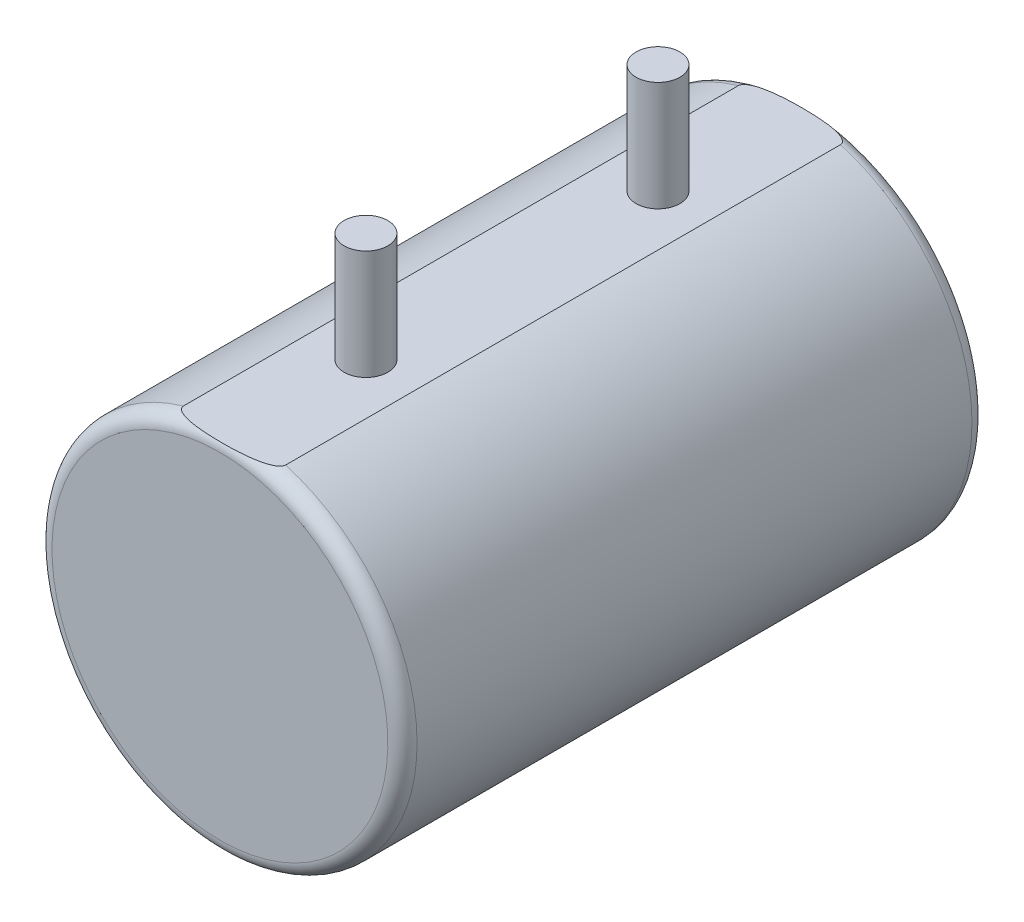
ISO-10303-21;
HEADER;
FILE_DESCRIPTION(('STEP AP214'),'2;1');
FILE_NAME('part.step','',(''),(''),'','','');
FILE_SCHEMA(('AUTOMOTIVE_DESIGN { 1 0 10303 214 1 1 1 1 }'));
ENDSEC;
DATA;
#1=APPLICATION_CONTEXT('core data for automotive mechanical design processes');
#2=APPLICATION_PROTOCOL_DEFINITION('international standard','automotive_design',2000,#1);
#3=PRODUCT_CONTEXT('',#1,'mechanical');
#4=PRODUCT('Part','Part','',(#3));
#5=PRODUCT_RELATED_PRODUCT_CATEGORY('part','',(#4));
#6=PRODUCT_DEFINITION_FORMATION('','',#4);
#7=PRODUCT_DEFINITION_CONTEXT('part definition',#1,'design');
#8=PRODUCT_DEFINITION('design','',#6,#7);
#9=PRODUCT_DEFINITION_SHAPE('','',#8);
#10=(LENGTH_UNIT() NAMED_UNIT(*) SI_UNIT(.MILLI.,.METRE.));
#11=(NAMED_UNIT(*) PLANE_ANGLE_UNIT() SI_UNIT($,.RADIAN.));
#12=(NAMED_UNIT(*) SI_UNIT($,.STERADIAN.) SOLID_ANGLE_UNIT());
#13=UNCERTAINTY_MEASURE_WITH_UNIT(LENGTH_MEASURE(1.E-05),#10,'distance_accuracy_value','');
#14=(GEOMETRIC_REPRESENTATION_CONTEXT(3) GLOBAL_UNCERTAINTY_ASSIGNED_CONTEXT((#13)) GLOBAL_UNIT_ASSIGNED_CONTEXT((#10,
#11,#12)) REPRESENTATION_CONTEXT('',''));
#15=CARTESIAN_POINT('',(0.,0.,0.));
#16=DIRECTION('',(0.,0.,1.));
#17=DIRECTION('',(1.,0.,0.));
#18=AXIS2_PLACEMENT_3D('',#15,#16,#17);
#19=CARTESIAN_POINT('',(-12.7271129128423,24.,-40.));
#20=DIRECTION('',(0.,-1.,0.));
#21=DIRECTION('',(0.,0.,-1.));
#22=AXIS2_PLACEMENT_3D('',#19,#20,#21);
#23=PLANE('',#22);
#24=CARTESIAN_POINT('',(0.,24.,-20.));
#25=DIRECTION('',(0.,-1.,0.));
#26=DIRECTION('',(0.,0.,-1.));
#27=AXIS2_PLACEMENT_3D('',#24,#25,#26);
#28=CIRCLE('',#27,3.);
#29=CARTESIAN_POINT('',(0.,24.,-23.));
#30=VERTEX_POINT('',#29);
#31=EDGE_CURVE('E81',#30,#30,#28,.F.);
#32=ORIENTED_EDGE('',*,*,#31,.F.);
#33=EDGE_LOOP('',(#32));
#34=FACE_BOUND('',#33,.T.);
#35=DIRECTION('',(0.,0.,-1.));
#36=VECTOR('',#35,1.);
#37=CARTESIAN_POINT('',(-7.00000000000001,24.,40.));
#38=LINE('',#37,#36);
#39=CARTESIAN_POINT('',(-7.00000000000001,24.,38.));
#40=VERTEX_POINT('',#39);
#41=CARTESIAN_POINT('',(-7.00000000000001,24.,-37.9999999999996));
#42=VERTEX_POINT('',#41);
#43=EDGE_CURVE('E75',#40,#42,#38,.T.);
#44=ORIENTED_EDGE('',*,*,#43,.F.);
#45=CARTESIAN_POINT('',(-7.,24.,38.));
#46=CARTESIAN_POINT('',(-7.00012010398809,24.,38.0371215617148));
#47=CARTESIAN_POINT('',(-6.99631525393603,24.,38.0740714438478));
#48=CARTESIAN_POINT('',(-6.98200666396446,24.,38.1461302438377));
#49=CARTESIAN_POINT('',(-6.97159894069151,24.,38.1812578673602));
#50=CARTESIAN_POINT('',(-6.94223615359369,24.,38.2568615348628));
#51=CARTESIAN_POINT('',(-6.9218935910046,24.,38.2967860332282));
#52=CARTESIAN_POINT('',(-6.87504129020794,24.,38.3730143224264));
#53=CARTESIAN_POINT('',(-6.84849655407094,24.,38.4092958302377));
#54=CARTESIAN_POINT('',(-6.77156367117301,24.,38.5017410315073));
#55=CARTESIAN_POINT('',(-6.71725604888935,24.,38.5546006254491));
#56=CARTESIAN_POINT('',(-6.60187103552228,24.,38.6520965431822));
#57=CARTESIAN_POINT('',(-6.5407809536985,24.,38.6967170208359));
#58=CARTESIAN_POINT('',(-6.39047758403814,24.,38.7953553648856));
#59=CARTESIAN_POINT('',(-6.29940083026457,24.,38.846498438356));
#60=CARTESIAN_POINT('',(-6.11280526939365,24.,38.9400616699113));
#61=CARTESIAN_POINT('',(-6.0172776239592,24.,38.9824634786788));
#62=CARTESIAN_POINT('',(-5.82302317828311,24.,39.0607714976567));
#63=CARTESIAN_POINT('',(-5.72428175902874,24.,39.0966409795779));
#64=CARTESIAN_POINT('',(-5.5251499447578,24.,39.1630055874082));
#65=CARTESIAN_POINT('',(-5.42476133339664,24.,39.1935061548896));
#66=CARTESIAN_POINT('',(-5.23127223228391,24.,39.2478047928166));
#67=CARTESIAN_POINT('',(-5.13826826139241,24.,39.2719507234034));
#68=CARTESIAN_POINT('',(-4.95151670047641,24.,39.3171879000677));
#69=CARTESIAN_POINT('',(-4.85776903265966,24.,39.3382788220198));
#70=CARTESIAN_POINT('',(-4.57561555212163,24.,39.3976775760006));
#71=CARTESIAN_POINT('',(-4.3863882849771,24.,39.4320874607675));
#72=CARTESIAN_POINT('',(-4.00629441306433,24.,39.4931380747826));
#73=CARTESIAN_POINT('',(-3.81542507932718,24.,39.5197611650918));
#74=CARTESIAN_POINT('',(-3.43291566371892,24.,39.5668379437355));
#75=CARTESIAN_POINT('',(-3.24127549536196,24.,39.5872909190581));
#76=CARTESIAN_POINT('',(-2.85741593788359,24.,39.6232455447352));
#77=CARTESIAN_POINT('',(-2.66519625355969,24.,39.6387439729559));
#78=CARTESIAN_POINT('',(-2.28046372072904,24.,39.6656422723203));
#79=CARTESIAN_POINT('',(-2.08795085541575,24.,39.6770418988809));
#80=CARTESIAN_POINT('',(-1.70301796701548,24.,39.6963509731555));
#81=CARTESIAN_POINT('',(-1.5105981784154,24.,39.7042651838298));
#82=CARTESIAN_POINT('',(-1.125655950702,24.,39.7170515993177));
#83=CARTESIAN_POINT('',(-0.933133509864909,24.,39.7219237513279));
#84=CARTESIAN_POINT('',(-0.550730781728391,24.,39.7288374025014));
#85=CARTESIAN_POINT('',(-0.36085117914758,24.,39.7309175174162));
#86=CARTESIAN_POINT('',(0.018918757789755,24.,39.7324806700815));
#87=CARTESIAN_POINT('',(0.20880909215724,24.,39.7319637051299));
#88=CARTESIAN_POINT('',(0.588680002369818,24.,39.7283048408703));
#89=CARTESIAN_POINT('',(0.778660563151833,24.,39.7251613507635));
#90=CARTESIAN_POINT('',(1.15855185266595,24.,39.7160841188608));
#91=CARTESIAN_POINT('',(1.34846258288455,24.,39.7101504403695));
#92=CARTESIAN_POINT('',(1.72845431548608,24.,39.6951722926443));
#93=CARTESIAN_POINT('',(1.91853513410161,24.,39.6861230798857));
#94=CARTESIAN_POINT('',(2.29848844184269,24.,39.6644397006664));
#95=CARTESIAN_POINT('',(2.48836093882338,24.,39.6518056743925));
#96=CARTESIAN_POINT('',(2.86764725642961,24.,39.6222851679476));
#97=CARTESIAN_POINT('',(3.05706130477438,24.,39.6054016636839));
#98=CARTESIAN_POINT('',(3.43534734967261,24.,39.5664445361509));
#99=CARTESIAN_POINT('',(3.62421939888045,24.,39.5443714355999));
#100=CARTESIAN_POINT('',(4.00271448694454,24.,39.4935151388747));
#101=CARTESIAN_POINT('',(4.19233014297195,24.,39.4646761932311));
#102=CARTESIAN_POINT('',(4.57032586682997,24.,39.3984669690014));
#103=CARTESIAN_POINT('',(4.75870446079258,24.,39.3610879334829));
#104=CARTESIAN_POINT('',(5.03869624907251,24.,39.296574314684));
#105=CARTESIAN_POINT('',(5.13130314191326,24.,39.2737492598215));
#106=CARTESIAN_POINT('',(5.31562004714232,24.,39.2247461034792));
#107=CARTESIAN_POINT('',(5.40733020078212,24.,39.1985685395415));
#108=CARTESIAN_POINT('',(5.58936067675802,24.,39.1422398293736));
#109=CARTESIAN_POINT('',(5.67968309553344,24.,39.1120955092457));
#110=CARTESIAN_POINT('',(5.85852574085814,24.,39.0469074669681));
#111=CARTESIAN_POINT('',(5.94704688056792,24.,39.0118663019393));
#112=CARTESIAN_POINT('',(6.07612354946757,24.,38.9553951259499));
#113=CARTESIAN_POINT('',(6.11771967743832,24.,38.9363445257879));
#114=CARTESIAN_POINT('',(6.20012616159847,24.,38.896611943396));
#115=CARTESIAN_POINT('',(6.24093641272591,24.,38.8759297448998));
#116=CARTESIAN_POINT('',(6.36200198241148,24.,38.8110634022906));
#117=CARTESIAN_POINT('',(6.44083192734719,24.,38.76408501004));
#118=CARTESIAN_POINT('',(6.57526000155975,24.,38.6716463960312));
#119=CARTESIAN_POINT('',(6.63216577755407,24.,38.6281057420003));
#120=CARTESIAN_POINT('',(6.73928493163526,24.,38.5333672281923));
#121=CARTESIAN_POINT('',(6.78951708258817,24.,38.4821917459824));
#122=CARTESIAN_POINT('',(6.85858982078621,24.,38.395475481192));
#123=CARTESIAN_POINT('',(6.88143482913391,24.,38.3631507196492));
#124=CARTESIAN_POINT('',(6.9222576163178,24.,38.2955618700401));
#125=CARTESIAN_POINT('',(6.94024438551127,24.,38.2603033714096));
#126=CARTESIAN_POINT('',(6.96759195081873,24.,38.1926756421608));
#127=CARTESIAN_POINT('',(6.97784430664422,24.,38.1606720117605));
#128=CARTESIAN_POINT('',(6.99282861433,24.,38.0953786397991));
#129=CARTESIAN_POINT('',(6.99756402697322,24.,38.0620897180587));
#130=CARTESIAN_POINT('',(7.00097118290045,24.,37.9951884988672));
#131=CARTESIAN_POINT('',(6.99963965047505,24.,37.9615760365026));
#132=CARTESIAN_POINT('',(6.99115784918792,24.,37.8948929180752));
#133=CARTESIAN_POINT('',(6.98397429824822,24.,37.8618264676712));
#134=CARTESIAN_POINT('',(6.97400090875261,24.,37.8296582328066));
#135=B_SPLINE_CURVE_WITH_KNOTS('',3,(#45,#46,#47,#48,#49,#50,#51,#52,#53,#54,#55,#56,#57,#58,
#59,#60,#61,#62,#63,#64,#65,#66,#67,#68,#69,#70,#71,#72,#73,#74,#75,#76,#77,#78,#79,#80,#81,#82,
#83,#84,#85,#86,#87,#88,#89,#90,#91,#92,#93,#94,#95,#96,#97,#98,#99,#100,#101,#102,#103,#104,
#105,#106,#107,#108,#109,#110,#111,#112,#113,#114,#115,#116,#117,#118,#119,#120,#121,#122,#123,
#124,#125,#126,#127,#128,#129,#130,#131,#132,#133,#134),.UNSPECIFIED.,.F.,.F.,(4,2,2,2,2,2,2,2,
2,2,2,2,2,2,2,2,2,2,2,2,2,2,2,2,2,2,2,2,2,2,2,2,2,2,2,2,2,2,2,2,2,2,2,2,4),(0.,
0.110894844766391,0.220212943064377,0.353881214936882,0.488322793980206,0.714400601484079,
0.940908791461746,1.25351414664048,1.56676917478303,1.88173449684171,2.19637872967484,
2.48458039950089,2.77281262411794,3.34955319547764,3.92759027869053,4.50569413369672,
5.08417319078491,5.66268676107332,6.24040729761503,6.81813786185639,7.38779273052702,
7.9574481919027,8.5274489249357,9.09743672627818,9.66829622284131,10.2391333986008,
10.8095719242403,11.3799530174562,11.9552101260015,12.5310597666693,12.8171464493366,
13.1031873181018,13.3887422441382,13.6741486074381,13.8113679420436,13.948605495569,
14.2232761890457,14.4378096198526,14.6517261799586,14.7701684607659,14.8883900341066,
14.9887914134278,15.089129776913,15.1895223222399,15.2904898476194),.UNSPECIFIED.);
#136=CARTESIAN_POINT('',(7.00000000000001,24.,37.9999999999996));
#137=VERTEX_POINT('',#136);
#138=EDGE_CURVE('E41',#40,#137,#135,.T.);
#139=ORIENTED_EDGE('',*,*,#138,.T.);
#140=DIRECTION('',(0.,0.,-1.));
#141=VECTOR('',#140,1.);
#142=CARTESIAN_POINT('',(7.00000000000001,24.,40.));
#143=LINE('',#142,#141);
#144=CARTESIAN_POINT('',(7.00000000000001,24.,-38.));
#145=VERTEX_POINT('',#144);
#146=EDGE_CURVE('E77',#145,#137,#143,.F.);
#147=ORIENTED_EDGE('',*,*,#146,.F.);
#148=CARTESIAN_POINT('',(7.,24.,-38.));
#149=CARTESIAN_POINT('',(7.00012010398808,24.,-38.0371215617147));
#150=CARTESIAN_POINT('',(6.99631525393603,24.,-38.0740714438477));
#151=CARTESIAN_POINT('',(6.98200666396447,24.,-38.1461302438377));
#152=CARTESIAN_POINT('',(6.97159894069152,24.,-38.1812578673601));
#153=CARTESIAN_POINT('',(6.94223615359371,24.,-38.2568615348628));
#154=CARTESIAN_POINT('',(6.92189359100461,24.,-38.2967860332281));
#155=CARTESIAN_POINT('',(6.87504129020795,24.,-38.3730143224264));
#156=CARTESIAN_POINT('',(6.84849655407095,24.,-38.4092958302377));
#157=CARTESIAN_POINT('',(6.77156367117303,24.,-38.5017410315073));
#158=CARTESIAN_POINT('',(6.71725604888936,24.,-38.5546006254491));
#159=CARTESIAN_POINT('',(6.6018710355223,24.,-38.6520965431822));
#160=CARTESIAN_POINT('',(6.54078095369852,24.,-38.6967170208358));
#161=CARTESIAN_POINT('',(6.39047758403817,24.,-38.7953553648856));
#162=CARTESIAN_POINT('',(6.29940083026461,24.,-38.846498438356));
#163=CARTESIAN_POINT('',(6.1128052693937,24.,-38.9400616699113));
#164=CARTESIAN_POINT('',(6.01727762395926,24.,-38.9824634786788));
#165=CARTESIAN_POINT('',(5.82302317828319,24.,-39.0607714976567));
#166=CARTESIAN_POINT('',(5.72428175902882,24.,-39.0966409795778));
#167=CARTESIAN_POINT('',(5.5251499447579,24.,-39.1630055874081));
#168=CARTESIAN_POINT('',(5.42476133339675,24.,-39.1935061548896));
#169=CARTESIAN_POINT('',(5.23127223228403,24.,-39.2478047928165));
#170=CARTESIAN_POINT('',(5.13826826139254,24.,-39.2719507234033));
#171=CARTESIAN_POINT('',(4.95151670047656,24.,-39.3171879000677));
#172=CARTESIAN_POINT('',(4.85776903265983,24.,-39.3382788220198));
#173=CARTESIAN_POINT('',(4.57561555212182,24.,-39.3976775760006));
#174=CARTESIAN_POINT('',(4.3863882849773,24.,-39.4320874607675));
#175=CARTESIAN_POINT('',(4.00629441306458,24.,-39.4931380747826));
#176=CARTESIAN_POINT('',(3.81542507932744,24.,-39.5197611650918));
#177=CARTESIAN_POINT('',(3.43291566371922,24.,-39.5668379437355));
#178=CARTESIAN_POINT('',(3.24127549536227,24.,-39.587290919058));
#179=CARTESIAN_POINT('',(2.85741593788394,24.,-39.6232455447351));
#180=CARTESIAN_POINT('',(2.66519625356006,24.,-39.6387439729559));
#181=CARTESIAN_POINT('',(2.28046372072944,24.,-39.6656422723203));
#182=CARTESIAN_POINT('',(2.08795085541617,24.,-39.6770418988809));
#183=CARTESIAN_POINT('',(1.70301796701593,24.,-39.6963509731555));
#184=CARTESIAN_POINT('',(1.51059817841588,24.,-39.7042651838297));
#185=CARTESIAN_POINT('',(1.12565595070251,24.,-39.7170515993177));
#186=CARTESIAN_POINT('',(0.933133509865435,24.,-39.7219237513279));
#187=CARTESIAN_POINT('',(0.55073078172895,24.,-39.7288374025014));
#188=CARTESIAN_POINT('',(0.360851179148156,24.,-39.7309175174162));
#189=CARTESIAN_POINT('',(-0.0189187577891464,24.,-39.7324806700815));
#190=CARTESIAN_POINT('',(-0.208809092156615,24.,-39.7319637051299));
#191=CARTESIAN_POINT('',(-0.588680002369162,24.,-39.7283048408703));
#192=CARTESIAN_POINT('',(-0.778660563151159,24.,-39.7251613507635));
#193=CARTESIAN_POINT('',(-1.15855185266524,24.,-39.7160841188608));
#194=CARTESIAN_POINT('',(-1.34846258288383,24.,-39.7101504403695));
#195=CARTESIAN_POINT('',(-1.72845431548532,24.,-39.6951722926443));
#196=CARTESIAN_POINT('',(-1.91853513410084,24.,-39.6861230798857));
#197=CARTESIAN_POINT('',(-2.29848844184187,24.,-39.6644397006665));
#198=CARTESIAN_POINT('',(-2.48836093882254,24.,-39.6518056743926));
#199=CARTESIAN_POINT('',(-2.86764725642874,24.,-39.6222851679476));
#200=CARTESIAN_POINT('',(-3.05706130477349,24.,-39.605401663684));
#201=CARTESIAN_POINT('',(-3.43534734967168,24.,-39.566444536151));
#202=CARTESIAN_POINT('',(-3.6242193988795,24.,-39.5443714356));
#203=CARTESIAN_POINT('',(-4.00271448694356,24.,-39.4935151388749));
#204=CARTESIAN_POINT('',(-4.19233014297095,24.,-39.4646761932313));
#205=CARTESIAN_POINT('',(-4.57032586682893,24.,-39.3984669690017));
#206=CARTESIAN_POINT('',(-4.75870446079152,24.,-39.3610879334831));
#207=CARTESIAN_POINT('',(-5.03869624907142,24.,-39.2965743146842));
#208=CARTESIAN_POINT('',(-5.13130314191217,24.,-39.2737492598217));
#209=CARTESIAN_POINT('',(-5.31562004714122,24.,-39.2247461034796));
#210=CARTESIAN_POINT('',(-5.40733020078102,24.,-39.1985685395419));
#211=CARTESIAN_POINT('',(-5.58936067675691,24.,-39.1422398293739));
#212=CARTESIAN_POINT('',(-5.67968309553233,24.,-39.112095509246));
#213=CARTESIAN_POINT('',(-5.85852574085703,24.,-39.0469074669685));
#214=CARTESIAN_POINT('',(-5.94704688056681,24.,-39.0118663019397));
#215=CARTESIAN_POINT('',(-6.07612354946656,24.,-38.9553951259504));
#216=CARTESIAN_POINT('',(-6.1177196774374,24.,-38.9363445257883));
#217=CARTESIAN_POINT('',(-6.20012616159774,24.,-38.8966119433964));
#218=CARTESIAN_POINT('',(-6.24093641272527,24.,-38.8759297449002));
#219=CARTESIAN_POINT('',(-6.36200198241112,24.,-38.8110634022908));
#220=CARTESIAN_POINT('',(-6.44083192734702,24.,-38.7640850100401));
#221=CARTESIAN_POINT('',(-6.57526000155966,24.,-38.6716463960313));
#222=CARTESIAN_POINT('',(-6.6321657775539,24.,-38.6281057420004));
#223=CARTESIAN_POINT('',(-6.73928493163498,24.,-38.5333672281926));
#224=CARTESIAN_POINT('',(-6.78951708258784,24.,-38.4821917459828));
#225=CARTESIAN_POINT('',(-6.8585898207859,24.,-38.3954754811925));
#226=CARTESIAN_POINT('',(-6.88143482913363,24.,-38.3631507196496));
#227=CARTESIAN_POINT('',(-6.9222576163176,24.,-38.2955618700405));
#228=CARTESIAN_POINT('',(-6.94024438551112,24.,-38.2603033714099));
#229=CARTESIAN_POINT('',(-6.96759195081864,24.,-38.1926756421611));
#230=CARTESIAN_POINT('',(-6.97784430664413,24.,-38.1606720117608));
#231=CARTESIAN_POINT('',(-6.99282861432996,24.,-38.0953786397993));
#232=CARTESIAN_POINT('',(-6.9975640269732,24.,-38.062089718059));
#233=CARTESIAN_POINT('',(-7.00097118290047,24.,-37.9951884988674));
#234=CARTESIAN_POINT('',(-6.99963965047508,24.,-37.9615760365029));
#235=CARTESIAN_POINT('',(-6.99115784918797,24.,-37.8948929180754));
#236=CARTESIAN_POINT('',(-6.98397429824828,24.,-37.8618264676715));
#237=CARTESIAN_POINT('',(-6.97400090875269,24.,-37.8296582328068));
#238=B_SPLINE_CURVE_WITH_KNOTS('',3,(#148,#149,#150,#151,#152,#153,#154,#155,#156,#157,#158,
#159,#160,#161,#162,#163,#164,#165,#166,#167,#168,#169,#170,#171,#172,#173,#174,#175,#176,#177,
#178,#179,#180,#181,#182,#183,#184,#185,#186,#187,#188,#189,#190,#191,#192,#193,#194,#195,#196,
#197,#198,#199,#200,#201,#202,#203,#204,#205,#206,#207,#208,#209,#210,#211,#212,#213,#214,#215,
#216,#217,#218,#219,#220,#221,#222,#223,#224,#225,#226,#227,#228,#229,#230,#231,#232,#233,#234,
#235,#236,#237),.UNSPECIFIED.,.F.,.F.,(4,2,2,2,2,2,2,2,2,2,2,2,2,2,2,2,2,2,2,2,2,2,2,2,2,2,2,2,
2,2,2,2,2,2,2,2,2,2,2,2,2,2,2,2,4),(0.,0.110894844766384,0.220212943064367,0.353881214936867,
0.488322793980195,0.714400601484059,0.940908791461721,1.25351414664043,1.56676917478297,
1.88173449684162,2.19637872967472,2.48458039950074,2.77281262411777,3.34955319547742,
3.92759027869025,4.50569413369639,5.08417319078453,5.66268676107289,6.24040729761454,
6.81813786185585,7.38779273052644,7.95744819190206,8.52744892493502,9.09743672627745,
9.66829622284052,10.2391333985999,10.8095719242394,11.3799530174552,11.9552101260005,
12.5310597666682,12.8171464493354,13.1031873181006,13.388742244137,13.6741486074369,
13.8113679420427,13.9486054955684,14.2232761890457,14.4378096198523,14.6517261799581,
14.7701684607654,14.8883900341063,14.9887914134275,15.0891297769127,15.1895223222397,
15.2904898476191),.UNSPECIFIED.);
#239=EDGE_CURVE('E70',#145,#42,#238,.T.);
#240=ORIENTED_EDGE('',*,*,#239,.T.);
#241=EDGE_LOOP('',(#44,#139,#147,#240));
#242=FACE_BOUND('',#241,.T.);
#243=CARTESIAN_POINT('',(0.,24.,20.));
#244=DIRECTION('',(0.,-1.,0.));
#245=DIRECTION('',(0.,0.,-1.));
#246=AXIS2_PLACEMENT_3D('',#243,#244,#245);
#247=CIRCLE('',#246,3.);
#248=CARTESIAN_POINT('',(0.,24.,17.));
#249=VERTEX_POINT('',#248);
#250=EDGE_CURVE('E84',#249,#249,#247,.F.);
#251=ORIENTED_EDGE('',*,*,#250,.F.);
#252=EDGE_LOOP('',(#251));
#253=FACE_BOUND('',#252,.T.);
#254=ADVANCED_FACE('F32',(#34,#242,#253),#23,.F.);
#255=CARTESIAN_POINT('',(0.,0.,40.));
#256=DIRECTION('',(0.,0.,-1.));
#257=DIRECTION('',(-1.,0.,0.));
#258=AXIS2_PLACEMENT_3D('',#255,#256,#257);
#259=CYLINDRICAL_SURFACE('',#258,25.);
#260=ORIENTED_EDGE('',*,*,#146,.T.);
#261=CARTESIAN_POINT('',(0.,0.,38.));
#262=DIRECTION('',(0.,0.,1.));
#263=DIRECTION('',(1.,0.,0.));
#264=AXIS2_PLACEMENT_3D('',#261,#262,#263);
#265=CIRCLE('',#264,25.);
#266=EDGE_CURVE('E65',#137,#40,#265,.F.);
#267=ORIENTED_EDGE('',*,*,#266,.T.);
#268=ORIENTED_EDGE('',*,*,#43,.T.);
#269=CARTESIAN_POINT('',(0.,0.,-38.));
#270=DIRECTION('',(0.,0.,1.));
#271=DIRECTION('',(1.,0.,0.));
#272=AXIS2_PLACEMENT_3D('',#269,#270,#271);
#273=CIRCLE('',#272,25.);
#274=EDGE_CURVE('E78',#42,#145,#273,.T.);
#275=ORIENTED_EDGE('',*,*,#274,.T.);
#276=EDGE_LOOP('',(#260,#267,#268,#275));
#277=FACE_BOUND('',#276,.T.);
#278=ADVANCED_FACE('F73',(#277),#259,.T.);
#279=CARTESIAN_POINT('',(0.,0.,40.));
#280=DIRECTION('',(0.,0.,1.));
#281=DIRECTION('',(1.,0.,0.));
#282=AXIS2_PLACEMENT_3D('',#279,#280,#281);
#283=PLANE('',#282);
#284=CARTESIAN_POINT('',(0.,0.,40.));
#285=DIRECTION('',(0.,0.,1.));
#286=DIRECTION('',(1.,0.,0.));
#287=AXIS2_PLACEMENT_3D('',#284,#285,#286);
#288=CIRCLE('',#287,23.);
#289=CARTESIAN_POINT('',(-6.44000000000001,22.08,40.));
#290=VERTEX_POINT('',#289);
#291=EDGE_CURVE('E49',#290,#290,#288,.T.);
#292=ORIENTED_EDGE('',*,*,#291,.T.);
#293=EDGE_LOOP('',(#292));
#294=FACE_BOUND('',#293,.T.);
#295=ADVANCED_FACE('F108',(#294),#283,.T.);
#296=CARTESIAN_POINT('',(0.,0.,-40.));
#297=DIRECTION('',(0.,0.,1.));
#298=DIRECTION('',(1.,0.,0.));
#299=AXIS2_PLACEMENT_3D('',#296,#297,#298);
#300=PLANE('',#299);
#301=CARTESIAN_POINT('',(0.,0.,-40.));
#302=DIRECTION('',(0.,0.,1.));
#303=DIRECTION('',(1.,0.,0.));
#304=AXIS2_PLACEMENT_3D('',#301,#302,#303);
#305=CIRCLE('',#304,23.);
#306=CARTESIAN_POINT('',(-6.44000000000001,22.08,-40.));
#307=VERTEX_POINT('',#306);
#308=EDGE_CURVE('E11',#307,#307,#305,.F.);
#309=ORIENTED_EDGE('',*,*,#308,.T.);
#310=EDGE_LOOP('',(#309));
#311=FACE_BOUND('',#310,.T.);
#312=ADVANCED_FACE('F112',(#311),#300,.F.);
#313=CARTESIAN_POINT('',(0.,39.,-20.));
#314=DIRECTION('',(0.,-1.,0.));
#315=DIRECTION('',(0.,0.,-1.));
#316=AXIS2_PLACEMENT_3D('',#313,#314,#315);
#317=CYLINDRICAL_SURFACE('',#316,3.);
#318=CARTESIAN_POINT('',(0.,39.,-20.));
#319=DIRECTION('',(0.,1.,0.));
#320=DIRECTION('',(0.,0.,1.));
#321=AXIS2_PLACEMENT_3D('',#318,#319,#320);
#322=CIRCLE('',#321,3.);
#323=CARTESIAN_POINT('',(0.,39.,-17.));
#324=VERTEX_POINT('',#323);
#325=EDGE_CURVE('E86',#324,#324,#322,.T.);
#326=ORIENTED_EDGE('',*,*,#325,.F.);
#327=EDGE_LOOP('',(#326));
#328=FACE_BOUND('',#327,.T.);
#329=ORIENTED_EDGE('',*,*,#31,.T.);
#330=EDGE_LOOP('',(#329));
#331=FACE_BOUND('',#330,.T.);
#332=ADVANCED_FACE('F106',(#328,#331),#317,.T.);
#333=CARTESIAN_POINT('',(0.,39.,-20.));
#334=DIRECTION('',(0.,1.,0.));
#335=DIRECTION('',(0.,0.,1.));
#336=AXIS2_PLACEMENT_3D('',#333,#334,#335);
#337=PLANE('',#336);
#338=ORIENTED_EDGE('',*,*,#325,.T.);
#339=EDGE_LOOP('',(#338));
#340=FACE_BOUND('',#339,.T.);
#341=ADVANCED_FACE('F131',(#340),#337,.T.);
#342=CARTESIAN_POINT('',(0.,39.,20.));
#343=DIRECTION('',(0.,-1.,0.));
#344=DIRECTION('',(0.,0.,-1.));
#345=AXIS2_PLACEMENT_3D('',#342,#343,#344);
#346=CYLINDRICAL_SURFACE('',#345,3.);
#347=CARTESIAN_POINT('',(0.,39.,20.));
#348=DIRECTION('',(0.,1.,0.));
#349=DIRECTION('',(0.,0.,1.));
#350=AXIS2_PLACEMENT_3D('',#347,#348,#349);
#351=CIRCLE('',#350,3.);
#352=CARTESIAN_POINT('',(0.,39.,23.));
#353=VERTEX_POINT('',#352);
#354=EDGE_CURVE('E143',#353,#353,#351,.T.);
#355=ORIENTED_EDGE('',*,*,#354,.F.);
#356=EDGE_LOOP('',(#355));
#357=FACE_BOUND('',#356,.T.);
#358=ORIENTED_EDGE('',*,*,#250,.T.);
#359=EDGE_LOOP('',(#358));
#360=FACE_BOUND('',#359,.T.);
#361=ADVANCED_FACE('F125',(#357,#360),#346,.T.);
#362=CARTESIAN_POINT('',(0.,39.,20.));
#363=DIRECTION('',(0.,1.,0.));
#364=DIRECTION('',(0.,0.,1.));
#365=AXIS2_PLACEMENT_3D('',#362,#363,#364);
#366=PLANE('',#365);
#367=ORIENTED_EDGE('',*,*,#354,.T.);
#368=EDGE_LOOP('',(#367));
#369=FACE_BOUND('',#368,.T.);
#370=ADVANCED_FACE('F120',(#369),#366,.T.);
#371=CARTESIAN_POINT('',(0.,0.,38.));
#372=DIRECTION('',(0.,0.,1.));
#373=DIRECTION('',(1.,0.,0.));
#374=AXIS2_PLACEMENT_3D('',#371,#372,#373);
#375=TOROIDAL_SURFACE('',#374,23.,2.);
#376=ORIENTED_EDGE('',*,*,#138,.F.);
#377=ORIENTED_EDGE('',*,*,#266,.F.);
#378=EDGE_LOOP('',(#376,#377));
#379=FACE_BOUND('',#378,.T.);
#380=ORIENTED_EDGE('',*,*,#291,.F.);
#381=EDGE_LOOP('',(#380));
#382=FACE_BOUND('',#381,.T.);
#383=ADVANCED_FACE('F64',(#379,#382),#375,.T.);
#384=CARTESIAN_POINT('',(0.,0.,-38.));
#385=DIRECTION('',(0.,0.,1.));
#386=DIRECTION('',(1.,0.,0.));
#387=AXIS2_PLACEMENT_3D('',#384,#385,#386);
#388=TOROIDAL_SURFACE('',#387,23.,2.);
#389=ORIENTED_EDGE('',*,*,#308,.F.);
#390=EDGE_LOOP('',(#389));
#391=FACE_BOUND('',#390,.T.);
#392=ORIENTED_EDGE('',*,*,#239,.F.);
#393=ORIENTED_EDGE('',*,*,#274,.F.);
#394=EDGE_LOOP('',(#392,#393));
#395=FACE_BOUND('',#394,.T.);
#396=ADVANCED_FACE('F34',(#391,#395),#388,.T.);
#397=CLOSED_SHELL('',(#254,#278,#295,#312,#332,#341,#361,#370,#383,#396));
#398=MANIFOLD_SOLID_BREP('B2',#397);
#399=ADVANCED_BREP_SHAPE_REPRESENTATION('',(#18,#398),#14);
#400=SHAPE_DEFINITION_REPRESENTATION(#9,#399);
ENDSEC;
END-ISO-10303-21;
